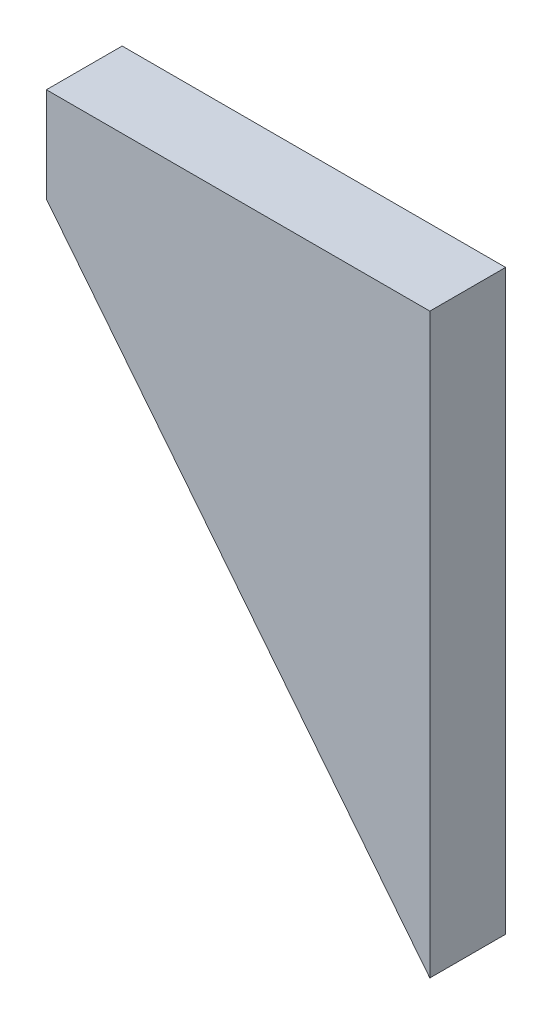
ISO-10303-21;
HEADER;
FILE_DESCRIPTION(('STEP AP214'),'2;1');
FILE_NAME('part.step','',(''),(''),'','','');
FILE_SCHEMA(('AUTOMOTIVE_DESIGN { 1 0 10303 214 1 1 1 1 }'));
ENDSEC;
DATA;
#1=APPLICATION_CONTEXT('core data for automotive mechanical design processes');
#2=APPLICATION_PROTOCOL_DEFINITION('international standard','automotive_design',2000,#1);
#3=PRODUCT_CONTEXT('',#1,'mechanical');
#4=PRODUCT('Part','Part','',(#3));
#5=PRODUCT_RELATED_PRODUCT_CATEGORY('part','',(#4));
#6=PRODUCT_DEFINITION_FORMATION('','',#4);
#7=PRODUCT_DEFINITION_CONTEXT('part definition',#1,'design');
#8=PRODUCT_DEFINITION('design','',#6,#7);
#9=PRODUCT_DEFINITION_SHAPE('','',#8);
#10=(LENGTH_UNIT() NAMED_UNIT(*) SI_UNIT(.MILLI.,.METRE.));
#11=(NAMED_UNIT(*) PLANE_ANGLE_UNIT() SI_UNIT($,.RADIAN.));
#12=(NAMED_UNIT(*) SI_UNIT($,.STERADIAN.) SOLID_ANGLE_UNIT());
#13=UNCERTAINTY_MEASURE_WITH_UNIT(LENGTH_MEASURE(1.E-05),#10,'distance_accuracy_value','');
#14=(GEOMETRIC_REPRESENTATION_CONTEXT(3) GLOBAL_UNCERTAINTY_ASSIGNED_CONTEXT((#13)) GLOBAL_UNIT_ASSIGNED_CONTEXT((#10,
#11,#12)) REPRESENTATION_CONTEXT('',''));
#15=CARTESIAN_POINT('',(0.,0.,0.));
#16=DIRECTION('',(0.,0.,1.));
#17=DIRECTION('',(1.,0.,0.));
#18=AXIS2_PLACEMENT_3D('',#15,#16,#17);
#19=CARTESIAN_POINT('',(40.5,-51.,8.));
#20=DIRECTION('',(0.783110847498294,0.621882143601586,0.));
#21=DIRECTION('',(-0.621882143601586,0.783110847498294,0.));
#22=AXIS2_PLACEMENT_3D('',#19,#20,#21);
#23=PLANE('',#22);
#24=DIRECTION('',(0.621882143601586,-0.783110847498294,0.));
#25=VECTOR('',#24,1.);
#26=CARTESIAN_POINT('',(40.5,-51.,0.));
#27=LINE('',#26,#25);
#28=CARTESIAN_POINT('',(0.,0.,0.));
#29=VERTEX_POINT('',#28);
#30=CARTESIAN_POINT('',(40.5,-51.,0.));
#31=VERTEX_POINT('',#30);
#32=EDGE_CURVE('E94',#29,#31,#27,.T.);
#33=ORIENTED_EDGE('',*,*,#32,.T.);
#34=DIRECTION('',(0.,0.,-1.));
#35=VECTOR('',#34,1.);
#36=CARTESIAN_POINT('',(40.5,-51.,8.));
#37=LINE('',#36,#35);
#38=CARTESIAN_POINT('',(40.5,-51.,8.));
#39=VERTEX_POINT('',#38);
#40=EDGE_CURVE('E11',#39,#31,#37,.T.);
#41=ORIENTED_EDGE('',*,*,#40,.F.);
#42=DIRECTION('',(0.621882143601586,-0.783110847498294,0.));
#43=VECTOR('',#42,1.);
#44=CARTESIAN_POINT('',(40.5,-51.,8.));
#45=LINE('',#44,#43);
#46=CARTESIAN_POINT('',(0.,0.,8.));
#47=VERTEX_POINT('',#46);
#48=EDGE_CURVE('E82',#47,#39,#45,.T.);
#49=ORIENTED_EDGE('',*,*,#48,.F.);
#50=DIRECTION('',(0.,0.,-1.));
#51=VECTOR('',#50,1.);
#52=CARTESIAN_POINT('',(0.,0.,8.));
#53=LINE('',#52,#51);
#54=EDGE_CURVE('E90',#47,#29,#53,.T.);
#55=ORIENTED_EDGE('',*,*,#54,.T.);
#56=EDGE_LOOP('',(#33,#41,#49,#55));
#57=FACE_BOUND('',#56,.T.);
#58=ADVANCED_FACE('F31',(#57),#23,.F.);
#59=CARTESIAN_POINT('',(40.5,10.,8.));
#60=DIRECTION('',(-1.,0.,0.));
#61=DIRECTION('',(0.,-1.,0.));
#62=AXIS2_PLACEMENT_3D('',#59,#60,#61);
#63=PLANE('',#62);
#64=DIRECTION('',(0.,1.,0.));
#65=VECTOR('',#64,1.);
#66=CARTESIAN_POINT('',(40.5,10.,0.));
#67=LINE('',#66,#65);
#68=CARTESIAN_POINT('',(40.5,10.,0.));
#69=VERTEX_POINT('',#68);
#70=EDGE_CURVE('E86',#31,#69,#67,.T.);
#71=ORIENTED_EDGE('',*,*,#70,.T.);
#72=DIRECTION('',(0.,0.,-1.));
#73=VECTOR('',#72,1.);
#74=CARTESIAN_POINT('',(40.5,10.,8.));
#75=LINE('',#74,#73);
#76=CARTESIAN_POINT('',(40.5,10.,8.));
#77=VERTEX_POINT('',#76);
#78=EDGE_CURVE('E39',#77,#69,#75,.T.);
#79=ORIENTED_EDGE('',*,*,#78,.F.);
#80=DIRECTION('',(0.,1.,0.));
#81=VECTOR('',#80,1.);
#82=CARTESIAN_POINT('',(40.5,10.,8.));
#83=LINE('',#82,#81);
#84=EDGE_CURVE('E77',#39,#77,#83,.T.);
#85=ORIENTED_EDGE('',*,*,#84,.F.);
#86=ORIENTED_EDGE('',*,*,#40,.T.);
#87=EDGE_LOOP('',(#71,#79,#85,#86));
#88=FACE_BOUND('',#87,.T.);
#89=ADVANCED_FACE('F85',(#88),#63,.F.);
#90=CARTESIAN_POINT('',(0.,10.,8.));
#91=DIRECTION('',(0.,-1.,0.));
#92=DIRECTION('',(0.,0.,-1.));
#93=AXIS2_PLACEMENT_3D('',#90,#91,#92);
#94=PLANE('',#93);
#95=DIRECTION('',(-1.,0.,0.));
#96=VECTOR('',#95,1.);
#97=CARTESIAN_POINT('',(0.,10.,0.));
#98=LINE('',#97,#96);
#99=CARTESIAN_POINT('',(0.,10.,0.));
#100=VERTEX_POINT('',#99);
#101=EDGE_CURVE('E64',#69,#100,#98,.T.);
#102=ORIENTED_EDGE('',*,*,#101,.T.);
#103=DIRECTION('',(0.,0.,-1.));
#104=VECTOR('',#103,1.);
#105=CARTESIAN_POINT('',(0.,10.,8.));
#106=LINE('',#105,#104);
#107=CARTESIAN_POINT('',(0.,10.,8.));
#108=VERTEX_POINT('',#107);
#109=EDGE_CURVE('E87',#108,#100,#106,.T.);
#110=ORIENTED_EDGE('',*,*,#109,.F.);
#111=DIRECTION('',(-1.,0.,0.));
#112=VECTOR('',#111,1.);
#113=CARTESIAN_POINT('',(0.,10.,8.));
#114=LINE('',#113,#112);
#115=EDGE_CURVE('E80',#77,#108,#114,.T.);
#116=ORIENTED_EDGE('',*,*,#115,.F.);
#117=ORIENTED_EDGE('',*,*,#78,.T.);
#118=EDGE_LOOP('',(#102,#110,#116,#117));
#119=FACE_BOUND('',#118,.T.);
#120=ADVANCED_FACE('F88',(#119),#94,.F.);
#121=CARTESIAN_POINT('',(0.,0.,8.));
#122=DIRECTION('',(1.,0.,0.));
#123=DIRECTION('',(0.,0.,-1.));
#124=AXIS2_PLACEMENT_3D('',#121,#122,#123);
#125=PLANE('',#124);
#126=DIRECTION('',(0.,-1.,0.));
#127=VECTOR('',#126,1.);
#128=CARTESIAN_POINT('',(0.,0.,0.));
#129=LINE('',#128,#127);
#130=EDGE_CURVE('E70',#100,#29,#129,.T.);
#131=ORIENTED_EDGE('',*,*,#130,.T.);
#132=ORIENTED_EDGE('',*,*,#54,.F.);
#133=DIRECTION('',(0.,-1.,0.));
#134=VECTOR('',#133,1.);
#135=CARTESIAN_POINT('',(0.,0.,8.));
#136=LINE('',#135,#134);
#137=EDGE_CURVE('E47',#108,#47,#136,.T.);
#138=ORIENTED_EDGE('',*,*,#137,.F.);
#139=ORIENTED_EDGE('',*,*,#109,.T.);
#140=EDGE_LOOP('',(#131,#132,#138,#139));
#141=FACE_BOUND('',#140,.T.);
#142=ADVANCED_FACE('F101',(#141),#125,.F.);
#143=CARTESIAN_POINT('',(-7.94117647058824,10.,8.));
#144=DIRECTION('',(0.,0.,-1.));
#145=DIRECTION('',(-1.,0.,0.));
#146=AXIS2_PLACEMENT_3D('',#143,#144,#145);
#147=PLANE('',#146);
#148=ORIENTED_EDGE('',*,*,#48,.T.);
#149=ORIENTED_EDGE('',*,*,#84,.T.);
#150=ORIENTED_EDGE('',*,*,#115,.T.);
#151=ORIENTED_EDGE('',*,*,#137,.T.);
#152=EDGE_LOOP('',(#148,#149,#150,#151));
#153=FACE_BOUND('',#152,.T.);
#154=ADVANCED_FACE('F78',(#153),#147,.F.);
#155=CARTESIAN_POINT('',(-7.94117647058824,10.,0.));
#156=DIRECTION('',(0.,0.,-1.));
#157=DIRECTION('',(-1.,0.,0.));
#158=AXIS2_PLACEMENT_3D('',#155,#156,#157);
#159=PLANE('',#158);
#160=ORIENTED_EDGE('',*,*,#32,.F.);
#161=ORIENTED_EDGE('',*,*,#130,.F.);
#162=ORIENTED_EDGE('',*,*,#101,.F.);
#163=ORIENTED_EDGE('',*,*,#70,.F.);
#164=EDGE_LOOP('',(#160,#161,#162,#163));
#165=FACE_BOUND('',#164,.T.);
#166=ADVANCED_FACE('F104',(#165),#159,.T.);
#167=CLOSED_SHELL('',(#58,#89,#120,#142,#154,#166));
#168=MANIFOLD_SOLID_BREP('B2',#167);
#169=ADVANCED_BREP_SHAPE_REPRESENTATION('',(#18,#168),#14);
#170=SHAPE_DEFINITION_REPRESENTATION(#9,#169);
ENDSEC;
END-ISO-10303-21;
